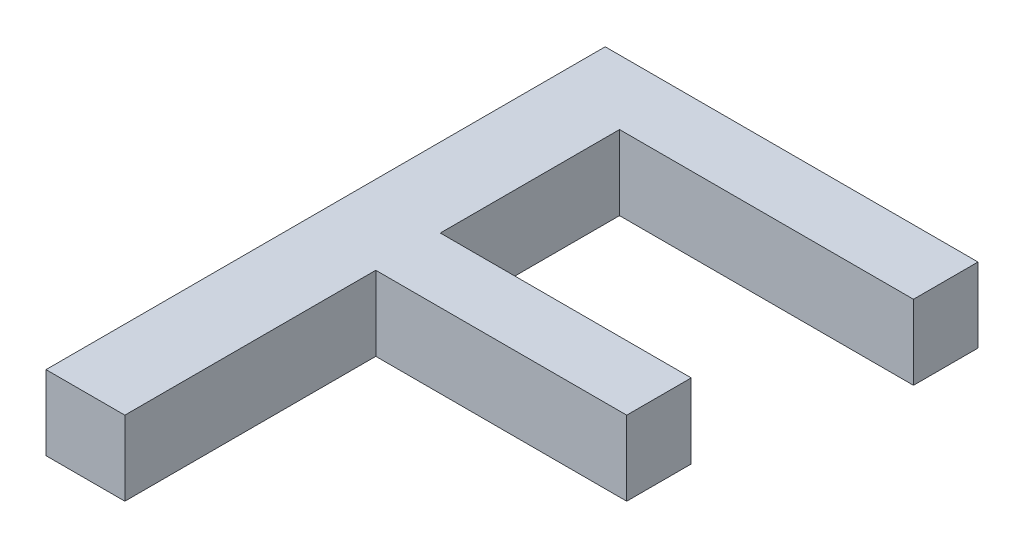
ISO-10303-21;
HEADER;
FILE_DESCRIPTION(('STEP AP214'),'2;1');
FILE_NAME('part.step','',(''),(''),'','','');
FILE_SCHEMA(('AUTOMOTIVE_DESIGN { 1 0 10303 214 1 1 1 1 }'));
ENDSEC;
DATA;
#1=APPLICATION_CONTEXT('core data for automotive mechanical design processes');
#2=APPLICATION_PROTOCOL_DEFINITION('international standard','automotive_design',2000,#1);
#3=PRODUCT_CONTEXT('',#1,'mechanical');
#4=PRODUCT('Part','Part','',(#3));
#5=PRODUCT_RELATED_PRODUCT_CATEGORY('part','',(#4));
#6=PRODUCT_DEFINITION_FORMATION('','',#4);
#7=PRODUCT_DEFINITION_CONTEXT('part definition',#1,'design');
#8=PRODUCT_DEFINITION('design','',#6,#7);
#9=PRODUCT_DEFINITION_SHAPE('','',#8);
#10=(LENGTH_UNIT() NAMED_UNIT(*) SI_UNIT(.MILLI.,.METRE.));
#11=(NAMED_UNIT(*) PLANE_ANGLE_UNIT() SI_UNIT($,.RADIAN.));
#12=(NAMED_UNIT(*) SI_UNIT($,.STERADIAN.) SOLID_ANGLE_UNIT());
#13=UNCERTAINTY_MEASURE_WITH_UNIT(LENGTH_MEASURE(1.E-05),#10,'distance_accuracy_value','');
#14=(GEOMETRIC_REPRESENTATION_CONTEXT(3) GLOBAL_UNCERTAINTY_ASSIGNED_CONTEXT((#13)) GLOBAL_UNIT_ASSIGNED_CONTEXT((#10,
#11,#12)) REPRESENTATION_CONTEXT('',''));
#15=CARTESIAN_POINT('',(0.,0.,0.));
#16=DIRECTION('',(0.,0.,1.));
#17=DIRECTION('',(1.,0.,0.));
#18=AXIS2_PLACEMENT_3D('',#15,#16,#17);
#19=CARTESIAN_POINT('',(0.,6.40008205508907,0.));
#20=DIRECTION('',(0.,1.,0.));
#21=DIRECTION('',(1.,0.,0.));
#22=AXIS2_PLACEMENT_3D('',#19,#20,#21);
#23=PLANE('',#22);
#24=DIRECTION('',(-1.,0.,0.));
#25=VECTOR('',#24,1.);
#26=CARTESIAN_POINT('',(0.,6.40008205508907,-11.2588025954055));
#27=LINE('',#26,#25);
#28=CARTESIAN_POINT('',(6.74992061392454,6.40008205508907,-11.2588025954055));
#29=VERTEX_POINT('',#28);
#30=CARTESIAN_POINT('',(6.07684369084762,6.40008205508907,-11.2588025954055));
#31=VERTEX_POINT('',#30);
#32=EDGE_CURVE('E151',#29,#31,#27,.T.);
#33=ORIENTED_EDGE('',*,*,#32,.T.);
#34=DIRECTION('',(0.,0.,1.));
#35=VECTOR('',#34,1.);
#36=CARTESIAN_POINT('',(6.07684369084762,6.40008205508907,0.));
#37=LINE('',#36,#35);
#38=CARTESIAN_POINT('',(6.07684369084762,6.40008205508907,-10.5857256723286));
#39=VERTEX_POINT('',#38);
#40=EDGE_CURVE('E24',#31,#39,#37,.T.);
#41=ORIENTED_EDGE('',*,*,#40,.T.);
#42=DIRECTION('',(-1.,0.,0.));
#43=VECTOR('',#42,1.);
#44=CARTESIAN_POINT('',(0.,6.40008205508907,-10.5857256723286));
#45=LINE('',#44,#43);
#46=CARTESIAN_POINT('',(5.86530522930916,6.40008205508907,-10.5857256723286));
#47=VERTEX_POINT('',#46);
#48=EDGE_CURVE('E216',#39,#47,#45,.T.);
#49=ORIENTED_EDGE('',*,*,#48,.T.);
#50=DIRECTION('',(0.,0.,-1.));
#51=VECTOR('',#50,1.);
#52=CARTESIAN_POINT('',(5.86530522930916,6.40008205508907,0.));
#53=LINE('',#52,#51);
#54=CARTESIAN_POINT('',(5.86530522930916,6.40008205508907,-12.0857256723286));
#55=VERTEX_POINT('',#54);
#56=EDGE_CURVE('E206',#47,#55,#53,.T.);
#57=ORIENTED_EDGE('',*,*,#56,.T.);
#58=DIRECTION('',(1.,0.,0.));
#59=VECTOR('',#58,1.);
#60=CARTESIAN_POINT('',(0.,6.40008205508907,-12.0857256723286));
#61=LINE('',#60,#59);
#62=CARTESIAN_POINT('',(6.86530522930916,6.40008205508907,-12.0857256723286));
#63=VERTEX_POINT('',#62);
#64=EDGE_CURVE('E196',#55,#63,#61,.T.);
#65=ORIENTED_EDGE('',*,*,#64,.T.);
#66=DIRECTION('',(0.,0.,1.));
#67=VECTOR('',#66,1.);
#68=CARTESIAN_POINT('',(6.86530522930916,6.40008205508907,0.));
#69=LINE('',#68,#67);
#70=CARTESIAN_POINT('',(6.86530522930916,6.40008205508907,-11.9126487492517));
#71=VERTEX_POINT('',#70);
#72=EDGE_CURVE('E128',#63,#71,#69,.T.);
#73=ORIENTED_EDGE('',*,*,#72,.T.);
#74=DIRECTION('',(-1.,0.,0.));
#75=VECTOR('',#74,1.);
#76=CARTESIAN_POINT('',(0.,6.40008205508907,-11.9126487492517));
#77=LINE('',#76,#75);
#78=CARTESIAN_POINT('',(6.07684369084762,6.40008205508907,-11.9126487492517));
#79=VERTEX_POINT('',#78);
#80=EDGE_CURVE('E140',#71,#79,#77,.T.);
#81=ORIENTED_EDGE('',*,*,#80,.T.);
#82=DIRECTION('',(0.,0.,1.));
#83=VECTOR('',#82,1.);
#84=CARTESIAN_POINT('',(6.07684369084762,6.40008205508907,0.));
#85=LINE('',#84,#83);
#86=CARTESIAN_POINT('',(6.07684369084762,6.40008205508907,-11.4318795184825));
#87=VERTEX_POINT('',#86);
#88=EDGE_CURVE('E143',#79,#87,#85,.T.);
#89=ORIENTED_EDGE('',*,*,#88,.T.);
#90=DIRECTION('',(1.,0.,0.));
#91=VECTOR('',#90,1.);
#92=CARTESIAN_POINT('',(0.,6.40008205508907,-11.4318795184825));
#93=LINE('',#92,#91);
#94=CARTESIAN_POINT('',(6.74992061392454,6.40008205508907,-11.4318795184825));
#95=VERTEX_POINT('',#94);
#96=EDGE_CURVE('E179',#87,#95,#93,.T.);
#97=ORIENTED_EDGE('',*,*,#96,.T.);
#98=DIRECTION('',(0.,0.,1.));
#99=VECTOR('',#98,1.);
#100=CARTESIAN_POINT('',(6.74992061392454,6.40008205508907,0.));
#101=LINE('',#100,#99);
#102=EDGE_CURVE('E169',#95,#29,#101,.T.);
#103=ORIENTED_EDGE('',*,*,#102,.T.);
#104=EDGE_LOOP('',(#33,#41,#49,#57,#65,#73,#81,#89,#97,#103));
#105=FACE_BOUND('',#104,.T.);
#106=ADVANCED_FACE('F16',(#105),#23,.F.);
#107=CARTESIAN_POINT('',(0.,6.60008205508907,0.));
#108=DIRECTION('',(0.,1.,0.));
#109=DIRECTION('',(1.,0.,0.));
#110=AXIS2_PLACEMENT_3D('',#107,#108,#109);
#111=PLANE('',#110);
#112=DIRECTION('',(-1.,0.,0.));
#113=VECTOR('',#112,1.);
#114=CARTESIAN_POINT('',(0.,6.60008205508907,-11.2588025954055));
#115=LINE('',#114,#113);
#116=CARTESIAN_POINT('',(6.74992061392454,6.60008205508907,-11.2588025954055));
#117=VERTEX_POINT('',#116);
#118=CARTESIAN_POINT('',(6.07684369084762,6.60008205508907,-11.2588025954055));
#119=VERTEX_POINT('',#118);
#120=EDGE_CURVE('E157',#117,#119,#115,.T.);
#121=ORIENTED_EDGE('',*,*,#120,.F.);
#122=DIRECTION('',(0.,0.,1.));
#123=VECTOR('',#122,1.);
#124=CARTESIAN_POINT('',(6.74992061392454,6.60008205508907,0.));
#125=LINE('',#124,#123);
#126=CARTESIAN_POINT('',(6.74992061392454,6.60008205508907,-11.4318795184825));
#127=VERTEX_POINT('',#126);
#128=EDGE_CURVE('E176',#127,#117,#125,.T.);
#129=ORIENTED_EDGE('',*,*,#128,.F.);
#130=DIRECTION('',(1.,0.,0.));
#131=VECTOR('',#130,1.);
#132=CARTESIAN_POINT('',(0.,6.60008205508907,-11.4318795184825));
#133=LINE('',#132,#131);
#134=CARTESIAN_POINT('',(6.07684369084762,6.60008205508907,-11.4318795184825));
#135=VERTEX_POINT('',#134);
#136=EDGE_CURVE('E135',#135,#127,#133,.T.);
#137=ORIENTED_EDGE('',*,*,#136,.F.);
#138=DIRECTION('',(0.,0.,1.));
#139=VECTOR('',#138,1.);
#140=CARTESIAN_POINT('',(6.07684369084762,6.60008205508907,0.));
#141=LINE('',#140,#139);
#142=CARTESIAN_POINT('',(6.07684369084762,6.60008205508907,-11.9126487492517));
#143=VERTEX_POINT('',#142);
#144=EDGE_CURVE('E131',#143,#135,#141,.T.);
#145=ORIENTED_EDGE('',*,*,#144,.F.);
#146=DIRECTION('',(-1.,0.,0.));
#147=VECTOR('',#146,1.);
#148=CARTESIAN_POINT('',(0.,6.60008205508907,-11.9126487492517));
#149=LINE('',#148,#147);
#150=CARTESIAN_POINT('',(6.86530522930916,6.60008205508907,-11.9126487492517));
#151=VERTEX_POINT('',#150);
#152=EDGE_CURVE('E116',#151,#143,#149,.T.);
#153=ORIENTED_EDGE('',*,*,#152,.F.);
#154=DIRECTION('',(0.,0.,1.));
#155=VECTOR('',#154,1.);
#156=CARTESIAN_POINT('',(6.86530522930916,6.60008205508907,0.));
#157=LINE('',#156,#155);
#158=CARTESIAN_POINT('',(6.86530522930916,6.60008205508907,-12.0857256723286));
#159=VERTEX_POINT('',#158);
#160=EDGE_CURVE('E193',#159,#151,#157,.T.);
#161=ORIENTED_EDGE('',*,*,#160,.F.);
#162=DIRECTION('',(1.,0.,0.));
#163=VECTOR('',#162,1.);
#164=CARTESIAN_POINT('',(0.,6.60008205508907,-12.0857256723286));
#165=LINE('',#164,#163);
#166=CARTESIAN_POINT('',(5.86530522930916,6.60008205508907,-12.0857256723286));
#167=VERTEX_POINT('',#166);
#168=EDGE_CURVE('E203',#167,#159,#165,.T.);
#169=ORIENTED_EDGE('',*,*,#168,.F.);
#170=DIRECTION('',(0.,0.,-1.));
#171=VECTOR('',#170,1.);
#172=CARTESIAN_POINT('',(5.86530522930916,6.60008205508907,0.));
#173=LINE('',#172,#171);
#174=CARTESIAN_POINT('',(5.86530522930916,6.60008205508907,-10.5857256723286));
#175=VERTEX_POINT('',#174);
#176=EDGE_CURVE('E213',#175,#167,#173,.T.);
#177=ORIENTED_EDGE('',*,*,#176,.F.);
#178=DIRECTION('',(-1.,0.,0.));
#179=VECTOR('',#178,1.);
#180=CARTESIAN_POINT('',(0.,6.60008205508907,-10.5857256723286));
#181=LINE('',#180,#179);
#182=CARTESIAN_POINT('',(6.07684369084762,6.60008205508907,-10.5857256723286));
#183=VERTEX_POINT('',#182);
#184=EDGE_CURVE('E222',#183,#175,#181,.T.);
#185=ORIENTED_EDGE('',*,*,#184,.F.);
#186=DIRECTION('',(0.,0.,1.));
#187=VECTOR('',#186,1.);
#188=CARTESIAN_POINT('',(6.07684369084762,6.60008205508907,0.));
#189=LINE('',#188,#187);
#190=EDGE_CURVE('E11',#119,#183,#189,.T.);
#191=ORIENTED_EDGE('',*,*,#190,.F.);
#192=EDGE_LOOP('',(#121,#129,#137,#145,#153,#161,#169,#177,#185,#191));
#193=FACE_BOUND('',#192,.T.);
#194=ADVANCED_FACE('F133',(#193),#111,.T.);
#195=CARTESIAN_POINT('',(6.07684369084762,6.60008205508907,0.));
#196=DIRECTION('',(1.,0.,0.));
#197=DIRECTION('',(0.,-1.,0.));
#198=AXIS2_PLACEMENT_3D('',#195,#196,#197);
#199=PLANE('',#198);
#200=ORIENTED_EDGE('',*,*,#40,.F.);
#201=DIRECTION('',(0.,-1.,0.));
#202=VECTOR('',#201,1.);
#203=CARTESIAN_POINT('',(6.07684369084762,6.60008205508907,-11.2588025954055));
#204=LINE('',#203,#202);
#205=EDGE_CURVE('E163',#119,#31,#204,.T.);
#206=ORIENTED_EDGE('',*,*,#205,.F.);
#207=ORIENTED_EDGE('',*,*,#190,.T.);
#208=DIRECTION('',(0.,-1.,0.));
#209=VECTOR('',#208,1.);
#210=CARTESIAN_POINT('',(6.07684369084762,6.60008205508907,-10.5857256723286));
#211=LINE('',#210,#209);
#212=EDGE_CURVE('E219',#183,#39,#211,.T.);
#213=ORIENTED_EDGE('',*,*,#212,.T.);
#214=EDGE_LOOP('',(#200,#206,#207,#213));
#215=FACE_BOUND('',#214,.T.);
#216=ADVANCED_FACE('F262',(#215),#199,.T.);
#217=CARTESIAN_POINT('',(0.,6.60008205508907,-10.5857256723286));
#218=DIRECTION('',(0.,0.,1.));
#219=DIRECTION('',(1.,0.,0.));
#220=AXIS2_PLACEMENT_3D('',#217,#218,#219);
#221=PLANE('',#220);
#222=ORIENTED_EDGE('',*,*,#48,.F.);
#223=ORIENTED_EDGE('',*,*,#212,.F.);
#224=ORIENTED_EDGE('',*,*,#184,.T.);
#225=DIRECTION('',(0.,-1.,0.));
#226=VECTOR('',#225,1.);
#227=CARTESIAN_POINT('',(5.86530522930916,6.60008205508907,-10.5857256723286));
#228=LINE('',#227,#226);
#229=EDGE_CURVE('E209',#175,#47,#228,.T.);
#230=ORIENTED_EDGE('',*,*,#229,.T.);
#231=EDGE_LOOP('',(#222,#223,#224,#230));
#232=FACE_BOUND('',#231,.T.);
#233=ADVANCED_FACE('F237',(#232),#221,.T.);
#234=CARTESIAN_POINT('',(5.86530522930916,6.60008205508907,0.));
#235=DIRECTION('',(-1.,0.,0.));
#236=DIRECTION('',(0.,0.,1.));
#237=AXIS2_PLACEMENT_3D('',#234,#235,#236);
#238=PLANE('',#237);
#239=ORIENTED_EDGE('',*,*,#56,.F.);
#240=ORIENTED_EDGE('',*,*,#229,.F.);
#241=ORIENTED_EDGE('',*,*,#176,.T.);
#242=DIRECTION('',(0.,-1.,0.));
#243=VECTOR('',#242,1.);
#244=CARTESIAN_POINT('',(5.86530522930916,6.60008205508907,-12.0857256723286));
#245=LINE('',#244,#243);
#246=EDGE_CURVE('E199',#167,#55,#245,.T.);
#247=ORIENTED_EDGE('',*,*,#246,.T.);
#248=EDGE_LOOP('',(#239,#240,#241,#247));
#249=FACE_BOUND('',#248,.T.);
#250=ADVANCED_FACE('F231',(#249),#238,.T.);
#251=CARTESIAN_POINT('',(0.,6.60008205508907,-12.0857256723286));
#252=DIRECTION('',(0.,0.,-1.));
#253=DIRECTION('',(0.,-1.,0.));
#254=AXIS2_PLACEMENT_3D('',#251,#252,#253);
#255=PLANE('',#254);
#256=ORIENTED_EDGE('',*,*,#64,.F.);
#257=ORIENTED_EDGE('',*,*,#246,.F.);
#258=ORIENTED_EDGE('',*,*,#168,.T.);
#259=DIRECTION('',(0.,-1.,0.));
#260=VECTOR('',#259,1.);
#261=CARTESIAN_POINT('',(6.86530522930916,6.60008205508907,-12.0857256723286));
#262=LINE('',#261,#260);
#263=EDGE_CURVE('E189',#159,#63,#262,.T.);
#264=ORIENTED_EDGE('',*,*,#263,.T.);
#265=EDGE_LOOP('',(#256,#257,#258,#264));
#266=FACE_BOUND('',#265,.T.);
#267=ADVANCED_FACE('F236',(#266),#255,.T.);
#268=CARTESIAN_POINT('',(6.86530522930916,6.60008205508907,0.));
#269=DIRECTION('',(1.,0.,0.));
#270=DIRECTION('',(0.,-1.,0.));
#271=AXIS2_PLACEMENT_3D('',#268,#269,#270);
#272=PLANE('',#271);
#273=ORIENTED_EDGE('',*,*,#72,.F.);
#274=ORIENTED_EDGE('',*,*,#263,.F.);
#275=ORIENTED_EDGE('',*,*,#160,.T.);
#276=DIRECTION('',(0.,-1.,0.));
#277=VECTOR('',#276,1.);
#278=CARTESIAN_POINT('',(6.86530522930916,6.60008205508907,-11.9126487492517));
#279=LINE('',#278,#277);
#280=EDGE_CURVE('E124',#151,#71,#279,.T.);
#281=ORIENTED_EDGE('',*,*,#280,.T.);
#282=EDGE_LOOP('',(#273,#274,#275,#281));
#283=FACE_BOUND('',#282,.T.);
#284=ADVANCED_FACE('F299',(#283),#272,.T.);
#285=CARTESIAN_POINT('',(0.,6.60008205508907,-11.9126487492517));
#286=DIRECTION('',(0.,0.,1.));
#287=DIRECTION('',(1.,0.,0.));
#288=AXIS2_PLACEMENT_3D('',#285,#286,#287);
#289=PLANE('',#288);
#290=ORIENTED_EDGE('',*,*,#80,.F.);
#291=ORIENTED_EDGE('',*,*,#280,.F.);
#292=ORIENTED_EDGE('',*,*,#152,.T.);
#293=DIRECTION('',(0.,-1.,0.));
#294=VECTOR('',#293,1.);
#295=CARTESIAN_POINT('',(6.07684369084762,6.60008205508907,-11.9126487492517));
#296=LINE('',#295,#294);
#297=EDGE_CURVE('E121',#143,#79,#296,.T.);
#298=ORIENTED_EDGE('',*,*,#297,.T.);
#299=EDGE_LOOP('',(#290,#291,#292,#298));
#300=FACE_BOUND('',#299,.T.);
#301=ADVANCED_FACE('F119',(#300),#289,.T.);
#302=CARTESIAN_POINT('',(6.07684369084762,6.60008205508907,0.));
#303=DIRECTION('',(1.,0.,0.));
#304=DIRECTION('',(0.,-1.,0.));
#305=AXIS2_PLACEMENT_3D('',#302,#303,#304);
#306=PLANE('',#305);
#307=ORIENTED_EDGE('',*,*,#88,.F.);
#308=ORIENTED_EDGE('',*,*,#297,.F.);
#309=ORIENTED_EDGE('',*,*,#144,.T.);
#310=DIRECTION('',(0.,-1.,0.));
#311=VECTOR('',#310,1.);
#312=CARTESIAN_POINT('',(6.07684369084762,6.60008205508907,-11.4318795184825));
#313=LINE('',#312,#311);
#314=EDGE_CURVE('E182',#135,#87,#313,.T.);
#315=ORIENTED_EDGE('',*,*,#314,.T.);
#316=EDGE_LOOP('',(#307,#308,#309,#315));
#317=FACE_BOUND('',#316,.T.);
#318=ADVANCED_FACE('F142',(#317),#306,.T.);
#319=CARTESIAN_POINT('',(0.,6.60008205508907,-11.4318795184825));
#320=DIRECTION('',(0.,0.,-1.));
#321=DIRECTION('',(0.,-1.,0.));
#322=AXIS2_PLACEMENT_3D('',#319,#320,#321);
#323=PLANE('',#322);
#324=ORIENTED_EDGE('',*,*,#96,.F.);
#325=ORIENTED_EDGE('',*,*,#314,.F.);
#326=ORIENTED_EDGE('',*,*,#136,.T.);
#327=DIRECTION('',(0.,-1.,0.));
#328=VECTOR('',#327,1.);
#329=CARTESIAN_POINT('',(6.74992061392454,6.60008205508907,-11.4318795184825));
#330=LINE('',#329,#328);
#331=EDGE_CURVE('E172',#127,#95,#330,.T.);
#332=ORIENTED_EDGE('',*,*,#331,.T.);
#333=EDGE_LOOP('',(#324,#325,#326,#332));
#334=FACE_BOUND('',#333,.T.);
#335=ADVANCED_FACE('F272',(#334),#323,.T.);
#336=CARTESIAN_POINT('',(6.74992061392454,6.60008205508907,0.));
#337=DIRECTION('',(1.,0.,0.));
#338=DIRECTION('',(0.,-1.,0.));
#339=AXIS2_PLACEMENT_3D('',#336,#337,#338);
#340=PLANE('',#339);
#341=ORIENTED_EDGE('',*,*,#102,.F.);
#342=ORIENTED_EDGE('',*,*,#331,.F.);
#343=ORIENTED_EDGE('',*,*,#128,.T.);
#344=DIRECTION('',(0.,-1.,0.));
#345=VECTOR('',#344,1.);
#346=CARTESIAN_POINT('',(6.74992061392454,6.60008205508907,-11.2588025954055));
#347=LINE('',#346,#345);
#348=EDGE_CURVE('E153',#117,#29,#347,.T.);
#349=ORIENTED_EDGE('',*,*,#348,.T.);
#350=EDGE_LOOP('',(#341,#342,#343,#349));
#351=FACE_BOUND('',#350,.T.);
#352=ADVANCED_FACE('F251',(#351),#340,.T.);
#353=CARTESIAN_POINT('',(0.,6.60008205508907,-11.2588025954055));
#354=DIRECTION('',(0.,0.,1.));
#355=DIRECTION('',(1.,0.,0.));
#356=AXIS2_PLACEMENT_3D('',#353,#354,#355);
#357=PLANE('',#356);
#358=ORIENTED_EDGE('',*,*,#32,.F.);
#359=ORIENTED_EDGE('',*,*,#348,.F.);
#360=ORIENTED_EDGE('',*,*,#120,.T.);
#361=ORIENTED_EDGE('',*,*,#205,.T.);
#362=EDGE_LOOP('',(#358,#359,#360,#361));
#363=FACE_BOUND('',#362,.T.);
#364=ADVANCED_FACE('F246',(#363),#357,.T.);
#365=CLOSED_SHELL('',(#106,#194,#216,#233,#250,#267,#284,#301,#318,#335,#352,#364));
#366=MANIFOLD_SOLID_BREP('B1',#365);
#367=ADVANCED_BREP_SHAPE_REPRESENTATION('',(#18,#366),#14);
#368=SHAPE_DEFINITION_REPRESENTATION(#9,#367);
ENDSEC;
END-ISO-10303-21;
